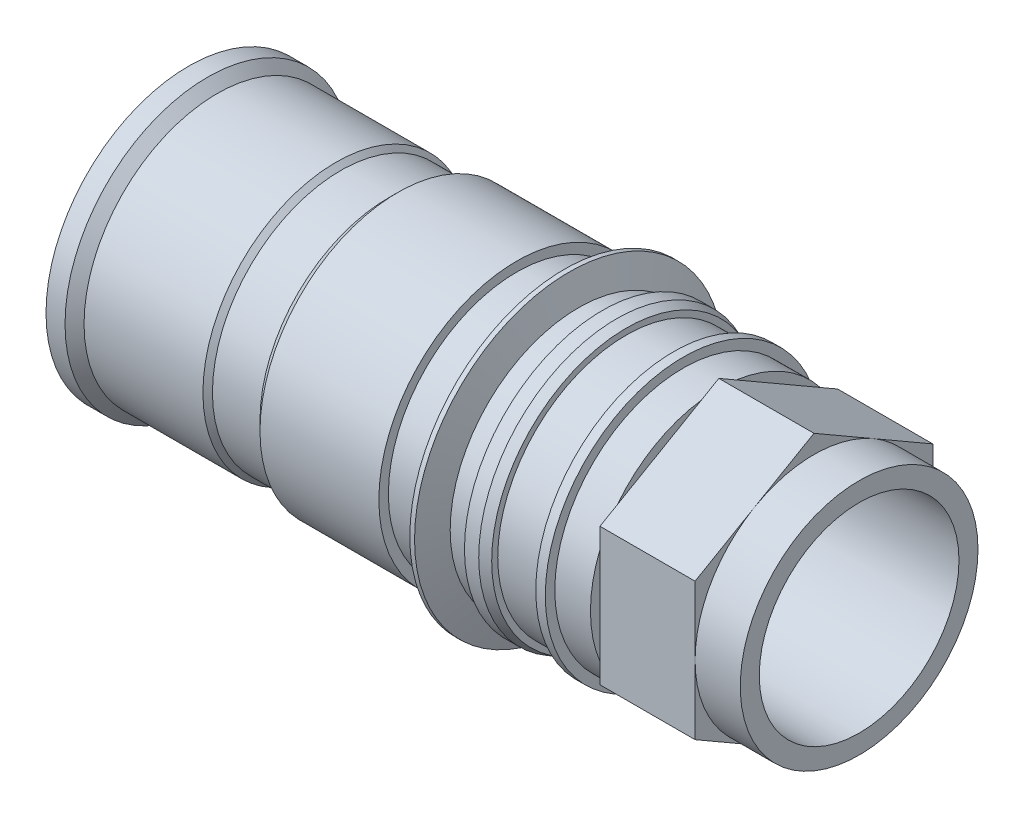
ISO-10303-21;
HEADER;
FILE_DESCRIPTION(('STEP AP214'),'2;1');
FILE_NAME('part.step','',(''),(''),'','','');
FILE_SCHEMA(('AUTOMOTIVE_DESIGN { 1 0 10303 214 1 1 1 1 }'));
ENDSEC;
DATA;
#1=APPLICATION_CONTEXT('core data for automotive mechanical design processes');
#2=APPLICATION_PROTOCOL_DEFINITION('international standard','automotive_design',2000,#1);
#3=PRODUCT_CONTEXT('',#1,'mechanical');
#4=PRODUCT('Part','Part','',(#3));
#5=PRODUCT_RELATED_PRODUCT_CATEGORY('part','',(#4));
#6=PRODUCT_DEFINITION_FORMATION('','',#4);
#7=PRODUCT_DEFINITION_CONTEXT('part definition',#1,'design');
#8=PRODUCT_DEFINITION('design','',#6,#7);
#9=PRODUCT_DEFINITION_SHAPE('','',#8);
#10=(LENGTH_UNIT() NAMED_UNIT(*) SI_UNIT(.MILLI.,.METRE.));
#11=(NAMED_UNIT(*) PLANE_ANGLE_UNIT() SI_UNIT($,.RADIAN.));
#12=(NAMED_UNIT(*) SI_UNIT($,.STERADIAN.) SOLID_ANGLE_UNIT());
#13=UNCERTAINTY_MEASURE_WITH_UNIT(LENGTH_MEASURE(1.E-05),#10,'distance_accuracy_value','');
#14=(GEOMETRIC_REPRESENTATION_CONTEXT(3) GLOBAL_UNCERTAINTY_ASSIGNED_CONTEXT((#13)) GLOBAL_UNIT_ASSIGNED_CONTEXT((#10,
#11,#12)) REPRESENTATION_CONTEXT('',''));
#15=CARTESIAN_POINT('',(0.,0.,0.));
#16=DIRECTION('',(0.,0.,1.));
#17=DIRECTION('',(1.,0.,0.));
#18=AXIS2_PLACEMENT_3D('',#15,#16,#17);
#19=CARTESIAN_POINT('',(131.5,0.,0.));
#20=DIRECTION('',(1.,0.,0.));
#21=DIRECTION('',(0.,0.,-1.));
#22=AXIS2_PLACEMENT_3D('',#19,#20,#21);
#23=PLANE('',#22);
#24=CARTESIAN_POINT('',(131.5,0.,0.));
#25=DIRECTION('',(1.,0.,0.));
#26=DIRECTION('',(0.,0.,-1.));
#27=AXIS2_PLACEMENT_3D('',#24,#25,#26);
#28=CIRCLE('',#27,25.);
#29=CARTESIAN_POINT('',(131.5,0.,-25.));
#30=VERTEX_POINT('',#29);
#31=CARTESIAN_POINT('',(131.5,21.650635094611,-12.5));
#32=VERTEX_POINT('',#31);
#33=EDGE_CURVE('E44',#30,#32,#28,.T.);
#34=ORIENTED_EDGE('',*,*,#33,.F.);
#35=DIRECTION('',(0.,1.,0.));
#36=VECTOR('',#35,1.);
#37=CARTESIAN_POINT('',(131.5,-14.4337567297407,-25.));
#38=LINE('',#37,#36);
#39=CARTESIAN_POINT('',(131.5,14.4337567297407,-25.));
#40=VERTEX_POINT('',#39);
#41=EDGE_CURVE('E150',#30,#40,#38,.T.);
#42=ORIENTED_EDGE('',*,*,#41,.T.);
#43=DIRECTION('',(0.,0.5,0.866025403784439));
#44=VECTOR('',#43,1.);
#45=CARTESIAN_POINT('',(131.5,14.4337567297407,-25.));
#46=LINE('',#45,#44);
#47=EDGE_CURVE('E162',#40,#32,#46,.T.);
#48=ORIENTED_EDGE('',*,*,#47,.T.);
#49=EDGE_LOOP('',(#34,#42,#48));
#50=FACE_BOUND('',#49,.T.);
#51=ADVANCED_FACE('F33',(#50),#23,.T.);
#52=CARTESIAN_POINT('',(131.5,21.650635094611,12.5));
#53=VERTEX_POINT('',#52);
#54=EDGE_CURVE('E11',#32,#53,#28,.T.);
#55=ORIENTED_EDGE('',*,*,#54,.F.);
#56=CARTESIAN_POINT('',(131.5,28.8675134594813,0.));
#57=VERTEX_POINT('',#56);
#58=EDGE_CURVE('E180',#32,#57,#46,.T.);
#59=ORIENTED_EDGE('',*,*,#58,.T.);
#60=DIRECTION('',(0.,-0.5,0.866025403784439));
#61=VECTOR('',#60,1.);
#62=CARTESIAN_POINT('',(131.5,28.8675134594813,0.));
#63=LINE('',#62,#61);
#64=EDGE_CURVE('E181',#57,#53,#63,.T.);
#65=ORIENTED_EDGE('',*,*,#64,.T.);
#66=EDGE_LOOP('',(#55,#59,#65));
#67=FACE_BOUND('',#66,.T.);
#68=ADVANCED_FACE('F371',(#67),#23,.T.);
#69=CARTESIAN_POINT('',(131.5,0.,25.));
#70=VERTEX_POINT('',#69);
#71=EDGE_CURVE('E42',#53,#70,#28,.T.);
#72=ORIENTED_EDGE('',*,*,#71,.F.);
#73=CARTESIAN_POINT('',(131.5,14.4337567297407,25.));
#74=VERTEX_POINT('',#73);
#75=EDGE_CURVE('E179',#53,#74,#63,.T.);
#76=ORIENTED_EDGE('',*,*,#75,.T.);
#77=DIRECTION('',(0.,-1.,0.));
#78=VECTOR('',#77,1.);
#79=CARTESIAN_POINT('',(131.5,14.4337567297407,25.));
#80=LINE('',#79,#78);
#81=EDGE_CURVE('E185',#74,#70,#80,.T.);
#82=ORIENTED_EDGE('',*,*,#81,.T.);
#83=EDGE_LOOP('',(#72,#76,#82));
#84=FACE_BOUND('',#83,.T.);
#85=ADVANCED_FACE('F376',(#84),#23,.T.);
#86=CARTESIAN_POINT('',(131.5,-21.650635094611,12.5));
#87=VERTEX_POINT('',#86);
#88=EDGE_CURVE('E169',#70,#87,#28,.T.);
#89=ORIENTED_EDGE('',*,*,#88,.F.);
#90=CARTESIAN_POINT('',(131.5,-14.4337567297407,25.));
#91=VERTEX_POINT('',#90);
#92=EDGE_CURVE('E184',#70,#91,#80,.T.);
#93=ORIENTED_EDGE('',*,*,#92,.T.);
#94=DIRECTION('',(0.,-0.5,-0.866025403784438));
#95=VECTOR('',#94,1.);
#96=CARTESIAN_POINT('',(131.5,-14.4337567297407,25.));
#97=LINE('',#96,#95);
#98=EDGE_CURVE('E189',#91,#87,#97,.T.);
#99=ORIENTED_EDGE('',*,*,#98,.T.);
#100=EDGE_LOOP('',(#89,#93,#99));
#101=FACE_BOUND('',#100,.T.);
#102=ADVANCED_FACE('F390',(#101),#23,.T.);
#103=CARTESIAN_POINT('',(131.5,-21.650635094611,-12.5));
#104=VERTEX_POINT('',#103);
#105=EDGE_CURVE('E59',#87,#104,#28,.T.);
#106=ORIENTED_EDGE('',*,*,#105,.F.);
#107=CARTESIAN_POINT('',(131.5,-28.8675134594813,0.));
#108=VERTEX_POINT('',#107);
#109=EDGE_CURVE('E188',#87,#108,#97,.T.);
#110=ORIENTED_EDGE('',*,*,#109,.T.);
#111=DIRECTION('',(0.,0.5,-0.866025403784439));
#112=VECTOR('',#111,1.);
#113=CARTESIAN_POINT('',(131.5,-28.8675134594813,0.));
#114=LINE('',#113,#112);
#115=EDGE_CURVE('E160',#108,#104,#114,.T.);
#116=ORIENTED_EDGE('',*,*,#115,.T.);
#117=EDGE_LOOP('',(#106,#110,#116));
#118=FACE_BOUND('',#117,.T.);
#119=ADVANCED_FACE('F381',(#118),#23,.T.);
#120=CARTESIAN_POINT('',(111.5,27.,0.));
#121=DIRECTION('',(-1.,0.,0.));
#122=DIRECTION('',(0.,0.,1.));
#123=AXIS2_PLACEMENT_3D('',#120,#121,#122);
#124=PLANE('',#123);
#125=DIRECTION('',(0.,0.5,0.866025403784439));
#126=VECTOR('',#125,1.);
#127=CARTESIAN_POINT('',(111.5,14.4337567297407,-25.));
#128=LINE('',#127,#126);
#129=CARTESIAN_POINT('',(111.5,16.5516155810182,-21.3317608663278));
#130=VERTEX_POINT('',#129);
#131=CARTESIAN_POINT('',(111.5,26.7496546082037,-3.6682391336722));
#132=VERTEX_POINT('',#131);
#133=EDGE_CURVE('E168',#130,#132,#128,.T.);
#134=ORIENTED_EDGE('',*,*,#133,.F.);
#135=CARTESIAN_POINT('',(111.5,0.,0.));
#136=DIRECTION('',(-1.,0.,0.));
#137=DIRECTION('',(0.,0.,1.));
#138=AXIS2_PLACEMENT_3D('',#135,#136,#137);
#139=CIRCLE('',#138,27.);
#140=EDGE_CURVE('E328',#132,#130,#139,.T.);
#141=ORIENTED_EDGE('',*,*,#140,.F.);
#142=EDGE_LOOP('',(#134,#141));
#143=FACE_BOUND('',#142,.T.);
#144=ADVANCED_FACE('F365',(#143),#124,.F.);
#145=DIRECTION('',(0.,1.,0.));
#146=VECTOR('',#145,1.);
#147=CARTESIAN_POINT('',(111.5,-14.4337567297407,-25.));
#148=LINE('',#147,#146);
#149=CARTESIAN_POINT('',(111.5,-10.1980390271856,-25.));
#150=VERTEX_POINT('',#149);
#151=CARTESIAN_POINT('',(111.5,10.1980390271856,-25.));
#152=VERTEX_POINT('',#151);
#153=EDGE_CURVE('E171',#150,#152,#148,.T.);
#154=ORIENTED_EDGE('',*,*,#153,.F.);
#155=EDGE_CURVE('E334',#152,#150,#139,.T.);
#156=ORIENTED_EDGE('',*,*,#155,.F.);
#157=EDGE_LOOP('',(#154,#156));
#158=FACE_BOUND('',#157,.T.);
#159=ADVANCED_FACE('F395',(#158),#124,.F.);
#160=DIRECTION('',(0.,0.5,-0.866025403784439));
#161=VECTOR('',#160,1.);
#162=CARTESIAN_POINT('',(111.5,-28.8675134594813,0.));
#163=LINE('',#162,#161);
#164=CARTESIAN_POINT('',(111.5,-26.7496546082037,-3.6682391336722));
#165=VERTEX_POINT('',#164);
#166=CARTESIAN_POINT('',(111.5,-16.5516155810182,-21.3317608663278));
#167=VERTEX_POINT('',#166);
#168=EDGE_CURVE('E214',#165,#167,#163,.T.);
#169=ORIENTED_EDGE('',*,*,#168,.F.);
#170=EDGE_CURVE('E340',#167,#165,#139,.T.);
#171=ORIENTED_EDGE('',*,*,#170,.F.);
#172=EDGE_LOOP('',(#169,#171));
#173=FACE_BOUND('',#172,.T.);
#174=ADVANCED_FACE('F366',(#173),#124,.F.);
#175=DIRECTION('',(0.,-0.5,-0.866025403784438));
#176=VECTOR('',#175,1.);
#177=CARTESIAN_POINT('',(111.5,-14.4337567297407,25.));
#178=LINE('',#177,#176);
#179=CARTESIAN_POINT('',(111.5,-16.5516155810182,21.3317608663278));
#180=VERTEX_POINT('',#179);
#181=CARTESIAN_POINT('',(111.5,-26.7496546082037,3.66823913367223));
#182=VERTEX_POINT('',#181);
#183=EDGE_CURVE('E209',#180,#182,#178,.T.);
#184=ORIENTED_EDGE('',*,*,#183,.F.);
#185=EDGE_CURVE('E346',#182,#180,#139,.T.);
#186=ORIENTED_EDGE('',*,*,#185,.F.);
#187=EDGE_LOOP('',(#184,#186));
#188=FACE_BOUND('',#187,.T.);
#189=ADVANCED_FACE('F359',(#188),#124,.F.);
#190=DIRECTION('',(0.,-1.,0.));
#191=VECTOR('',#190,1.);
#192=CARTESIAN_POINT('',(111.5,14.4337567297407,25.));
#193=LINE('',#192,#191);
#194=CARTESIAN_POINT('',(111.5,10.1980390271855,25.));
#195=VERTEX_POINT('',#194);
#196=CARTESIAN_POINT('',(111.5,-10.1980390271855,25.));
#197=VERTEX_POINT('',#196);
#198=EDGE_CURVE('E204',#195,#197,#193,.T.);
#199=ORIENTED_EDGE('',*,*,#198,.F.);
#200=EDGE_CURVE('E232',#197,#195,#139,.T.);
#201=ORIENTED_EDGE('',*,*,#200,.F.);
#202=EDGE_LOOP('',(#199,#201));
#203=FACE_BOUND('',#202,.T.);
#204=ADVANCED_FACE('F357',(#203),#124,.F.);
#205=DIRECTION('',(0.,-0.5,0.866025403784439));
#206=VECTOR('',#205,1.);
#207=CARTESIAN_POINT('',(111.5,28.8675134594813,0.));
#208=LINE('',#207,#206);
#209=CARTESIAN_POINT('',(111.5,26.7496546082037,3.6682391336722));
#210=VERTEX_POINT('',#209);
#211=CARTESIAN_POINT('',(111.5,16.5516155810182,21.3317608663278));
#212=VERTEX_POINT('',#211);
#213=EDGE_CURVE('E199',#210,#212,#208,.T.);
#214=ORIENTED_EDGE('',*,*,#213,.F.);
#215=EDGE_CURVE('E236',#212,#210,#139,.T.);
#216=ORIENTED_EDGE('',*,*,#215,.F.);
#217=EDGE_LOOP('',(#214,#216));
#218=FACE_BOUND('',#217,.T.);
#219=ADVANCED_FACE('F326',(#218),#124,.F.);
#220=CARTESIAN_POINT('',(0.,0.,0.));
#221=DIRECTION('',(1.,0.,0.));
#222=DIRECTION('',(0.,0.,-1.));
#223=AXIS2_PLACEMENT_3D('',#220,#221,#222);
#224=PLANE('',#223);
#225=CARTESIAN_POINT('',(0.,0.,0.));
#226=DIRECTION('',(1.,0.,0.));
#227=DIRECTION('',(0.,0.,-1.));
#228=AXIS2_PLACEMENT_3D('',#225,#226,#227);
#229=CIRCLE('',#228,21.);
#230=CARTESIAN_POINT('',(0.,0.,-21.));
#231=VERTEX_POINT('',#230);
#232=EDGE_CURVE('E165',#231,#231,#229,.T.);
#233=ORIENTED_EDGE('',*,*,#232,.T.);
#234=EDGE_LOOP('',(#233));
#235=FACE_BOUND('',#234,.T.);
#236=CARTESIAN_POINT('',(0.,0.,0.));
#237=DIRECTION('',(-1.,0.,0.));
#238=DIRECTION('',(0.,0.,1.));
#239=AXIS2_PLACEMENT_3D('',#236,#237,#238);
#240=CIRCLE('',#239,30.);
#241=CARTESIAN_POINT('',(0.,0.,30.));
#242=VERTEX_POINT('',#241);
#243=EDGE_CURVE('E37',#242,#242,#240,.T.);
#244=ORIENTED_EDGE('',*,*,#243,.T.);
#245=EDGE_LOOP('',(#244));
#246=FACE_BOUND('',#245,.T.);
#247=ADVANCED_FACE('F35',(#235,#246),#224,.F.);
#248=CARTESIAN_POINT('',(0.,0.,0.));
#249=DIRECTION('',(-1.,0.,0.));
#250=DIRECTION('',(0.,0.,1.));
#251=AXIS2_PLACEMENT_3D('',#248,#249,#250);
#252=CYLINDRICAL_SURFACE('',#251,30.);
#253=ORIENTED_EDGE('',*,*,#243,.F.);
#254=EDGE_LOOP('',(#253));
#255=FACE_BOUND('',#254,.T.);
#256=CARTESIAN_POINT('',(4.,0.,0.));
#257=DIRECTION('',(-1.,0.,0.));
#258=DIRECTION('',(0.,0.,1.));
#259=AXIS2_PLACEMENT_3D('',#256,#257,#258);
#260=CIRCLE('',#259,30.);
#261=CARTESIAN_POINT('',(4.,0.,30.));
#262=VERTEX_POINT('',#261);
#263=EDGE_CURVE('E295',#262,#262,#260,.T.);
#264=ORIENTED_EDGE('',*,*,#263,.T.);
#265=EDGE_LOOP('',(#264));
#266=FACE_BOUND('',#265,.T.);
#267=ADVANCED_FACE('F490',(#255,#266),#252,.T.);
#268=CARTESIAN_POINT('',(6.,0.,0.));
#269=DIRECTION('',(-1.,0.,0.));
#270=DIRECTION('',(0.,0.,1.));
#271=AXIS2_PLACEMENT_3D('',#268,#269,#270);
#272=CONICAL_SURFACE('',#271,28.,0.78539816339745);
#273=ORIENTED_EDGE('',*,*,#263,.F.);
#274=EDGE_LOOP('',(#273));
#275=FACE_BOUND('',#274,.T.);
#276=CARTESIAN_POINT('',(6.,0.,0.));
#277=DIRECTION('',(-1.,0.,0.));
#278=DIRECTION('',(0.,0.,1.));
#279=AXIS2_PLACEMENT_3D('',#276,#277,#278);
#280=CIRCLE('',#279,28.);
#281=CARTESIAN_POINT('',(6.,0.,28.));
#282=VERTEX_POINT('',#281);
#283=EDGE_CURVE('E293',#282,#282,#280,.T.);
#284=ORIENTED_EDGE('',*,*,#283,.T.);
#285=EDGE_LOOP('',(#284));
#286=FACE_BOUND('',#285,.T.);
#287=ADVANCED_FACE('F528',(#275,#286),#272,.T.);
#288=CARTESIAN_POINT('',(0.,0.,0.));
#289=DIRECTION('',(-1.,0.,0.));
#290=DIRECTION('',(0.,0.,1.));
#291=AXIS2_PLACEMENT_3D('',#288,#289,#290);
#292=CYLINDRICAL_SURFACE('',#291,28.);
#293=ORIENTED_EDGE('',*,*,#283,.F.);
#294=EDGE_LOOP('',(#293));
#295=FACE_BOUND('',#294,.T.);
#296=CARTESIAN_POINT('',(31.,0.,0.));
#297=DIRECTION('',(-1.,0.,0.));
#298=DIRECTION('',(0.,0.,1.));
#299=AXIS2_PLACEMENT_3D('',#296,#297,#298);
#300=CIRCLE('',#299,28.);
#301=CARTESIAN_POINT('',(31.,0.,28.));
#302=VERTEX_POINT('',#301);
#303=EDGE_CURVE('E290',#302,#302,#300,.T.);
#304=ORIENTED_EDGE('',*,*,#303,.T.);
#305=EDGE_LOOP('',(#304));
#306=FACE_BOUND('',#305,.T.);
#307=ADVANCED_FACE('F534',(#295,#306),#292,.T.);
#308=CARTESIAN_POINT('',(32.,0.,0.));
#309=DIRECTION('',(-1.,0.,0.));
#310=DIRECTION('',(0.,0.,1.));
#311=AXIS2_PLACEMENT_3D('',#308,#309,#310);
#312=CONICAL_SURFACE('',#311,27.,0.785398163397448);
#313=ORIENTED_EDGE('',*,*,#303,.F.);
#314=EDGE_LOOP('',(#313));
#315=FACE_BOUND('',#314,.T.);
#316=CARTESIAN_POINT('',(32.,0.,0.));
#317=DIRECTION('',(-1.,0.,0.));
#318=DIRECTION('',(0.,0.,1.));
#319=AXIS2_PLACEMENT_3D('',#316,#317,#318);
#320=CIRCLE('',#319,27.);
#321=CARTESIAN_POINT('',(32.,0.,27.));
#322=VERTEX_POINT('',#321);
#323=EDGE_CURVE('E287',#322,#322,#320,.T.);
#324=ORIENTED_EDGE('',*,*,#323,.T.);
#325=EDGE_LOOP('',(#324));
#326=FACE_BOUND('',#325,.T.);
#327=ADVANCED_FACE('F542',(#315,#326),#312,.T.);
#328=CARTESIAN_POINT('',(0.,0.,0.));
#329=DIRECTION('',(-1.,0.,0.));
#330=DIRECTION('',(0.,0.,1.));
#331=AXIS2_PLACEMENT_3D('',#328,#329,#330);
#332=CYLINDRICAL_SURFACE('',#331,27.);
#333=ORIENTED_EDGE('',*,*,#323,.F.);
#334=EDGE_LOOP('',(#333));
#335=FACE_BOUND('',#334,.T.);
#336=CARTESIAN_POINT('',(42.,0.,0.));
#337=DIRECTION('',(-1.,0.,0.));
#338=DIRECTION('',(0.,0.,1.));
#339=AXIS2_PLACEMENT_3D('',#336,#337,#338);
#340=CIRCLE('',#339,27.);
#341=CARTESIAN_POINT('',(42.,0.,27.));
#342=VERTEX_POINT('',#341);
#343=EDGE_CURVE('E284',#342,#342,#340,.T.);
#344=ORIENTED_EDGE('',*,*,#343,.T.);
#345=EDGE_LOOP('',(#344));
#346=FACE_BOUND('',#345,.T.);
#347=ADVANCED_FACE('F550',(#335,#346),#332,.T.);
#348=CARTESIAN_POINT('',(44.,0.,0.));
#349=DIRECTION('',(1.,0.,0.));
#350=DIRECTION('',(0.,0.,-1.));
#351=AXIS2_PLACEMENT_3D('',#348,#349,#350);
#352=CONICAL_SURFACE('',#351,29.,0.785398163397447);
#353=ORIENTED_EDGE('',*,*,#343,.F.);
#354=EDGE_LOOP('',(#353));
#355=FACE_BOUND('',#354,.T.);
#356=CARTESIAN_POINT('',(44.,0.,0.));
#357=DIRECTION('',(-1.,0.,0.));
#358=DIRECTION('',(0.,0.,1.));
#359=AXIS2_PLACEMENT_3D('',#356,#357,#358);
#360=CIRCLE('',#359,29.);
#361=CARTESIAN_POINT('',(44.,0.,29.));
#362=VERTEX_POINT('',#361);
#363=EDGE_CURVE('E281',#362,#362,#360,.T.);
#364=ORIENTED_EDGE('',*,*,#363,.T.);
#365=EDGE_LOOP('',(#364));
#366=FACE_BOUND('',#365,.T.);
#367=ADVANCED_FACE('F558',(#355,#366),#352,.T.);
#368=CARTESIAN_POINT('',(0.,0.,0.));
#369=DIRECTION('',(-1.,0.,0.));
#370=DIRECTION('',(0.,0.,1.));
#371=AXIS2_PLACEMENT_3D('',#368,#369,#370);
#372=CYLINDRICAL_SURFACE('',#371,29.);
#373=ORIENTED_EDGE('',*,*,#363,.F.);
#374=EDGE_LOOP('',(#373));
#375=FACE_BOUND('',#374,.T.);
#376=CARTESIAN_POINT('',(69.,0.,0.));
#377=DIRECTION('',(-1.,0.,0.));
#378=DIRECTION('',(0.,0.,1.));
#379=AXIS2_PLACEMENT_3D('',#376,#377,#378);
#380=CIRCLE('',#379,29.);
#381=CARTESIAN_POINT('',(69.,0.,29.));
#382=VERTEX_POINT('',#381);
#383=EDGE_CURVE('E278',#382,#382,#380,.T.);
#384=ORIENTED_EDGE('',*,*,#383,.T.);
#385=EDGE_LOOP('',(#384));
#386=FACE_BOUND('',#385,.T.);
#387=ADVANCED_FACE('F566',(#375,#386),#372,.T.);
#388=CARTESIAN_POINT('',(69.,29.,0.));
#389=DIRECTION('',(-1.,0.,0.));
#390=DIRECTION('',(0.,0.,1.));
#391=AXIS2_PLACEMENT_3D('',#388,#389,#390);
#392=PLANE('',#391);
#393=ORIENTED_EDGE('',*,*,#383,.F.);
#394=EDGE_LOOP('',(#393));
#395=FACE_BOUND('',#394,.T.);
#396=CARTESIAN_POINT('',(69.,0.,0.));
#397=DIRECTION('',(-1.,0.,0.));
#398=DIRECTION('',(0.,0.,1.));
#399=AXIS2_PLACEMENT_3D('',#396,#397,#398);
#400=CIRCLE('',#399,27.);
#401=CARTESIAN_POINT('',(69.,0.,27.));
#402=VERTEX_POINT('',#401);
#403=EDGE_CURVE('E275',#402,#402,#400,.T.);
#404=ORIENTED_EDGE('',*,*,#403,.T.);
#405=EDGE_LOOP('',(#404));
#406=FACE_BOUND('',#405,.T.);
#407=ADVANCED_FACE('F574',(#395,#406),#392,.F.);
#408=CARTESIAN_POINT('',(0.,0.,0.));
#409=DIRECTION('',(-1.,0.,0.));
#410=DIRECTION('',(0.,0.,1.));
#411=AXIS2_PLACEMENT_3D('',#408,#409,#410);
#412=CYLINDRICAL_SURFACE('',#411,27.);
#413=ORIENTED_EDGE('',*,*,#403,.F.);
#414=EDGE_LOOP('',(#413));
#415=FACE_BOUND('',#414,.T.);
#416=CARTESIAN_POINT('',(77.,0.,0.));
#417=DIRECTION('',(-1.,0.,0.));
#418=DIRECTION('',(0.,0.,1.));
#419=AXIS2_PLACEMENT_3D('',#416,#417,#418);
#420=CIRCLE('',#419,27.);
#421=CARTESIAN_POINT('',(77.,0.,27.));
#422=VERTEX_POINT('',#421);
#423=EDGE_CURVE('E272',#422,#422,#420,.T.);
#424=ORIENTED_EDGE('',*,*,#423,.T.);
#425=EDGE_LOOP('',(#424));
#426=FACE_BOUND('',#425,.T.);
#427=ADVANCED_FACE('F582',(#415,#426),#412,.T.);
#428=CARTESIAN_POINT('',(79.,0.,0.));
#429=DIRECTION('',(1.,0.,0.));
#430=DIRECTION('',(0.,0.,-1.));
#431=AXIS2_PLACEMENT_3D('',#428,#429,#430);
#432=CONICAL_SURFACE('',#431,32.4949548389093,1.22173047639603);
#433=ORIENTED_EDGE('',*,*,#423,.F.);
#434=EDGE_LOOP('',(#433));
#435=FACE_BOUND('',#434,.T.);
#436=CARTESIAN_POINT('',(79.,0.,0.));
#437=DIRECTION('',(-1.,0.,0.));
#438=DIRECTION('',(0.,0.,1.));
#439=AXIS2_PLACEMENT_3D('',#436,#437,#438);
#440=CIRCLE('',#439,32.4949548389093);
#441=CARTESIAN_POINT('',(79.,0.,32.4949548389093));
#442=VERTEX_POINT('',#441);
#443=EDGE_CURVE('E269',#442,#442,#440,.T.);
#444=ORIENTED_EDGE('',*,*,#443,.T.);
#445=EDGE_LOOP('',(#444));
#446=FACE_BOUND('',#445,.T.);
#447=ADVANCED_FACE('F590',(#435,#446),#432,.T.);
#448=CARTESIAN_POINT('',(0.,0.,0.));
#449=DIRECTION('',(-1.,0.,0.));
#450=DIRECTION('',(0.,0.,1.));
#451=AXIS2_PLACEMENT_3D('',#448,#449,#450);
#452=CYLINDRICAL_SURFACE('',#451,32.4949548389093);
#453=ORIENTED_EDGE('',*,*,#443,.F.);
#454=EDGE_LOOP('',(#453));
#455=FACE_BOUND('',#454,.T.);
#456=CARTESIAN_POINT('',(80.,0.,0.));
#457=DIRECTION('',(-1.,0.,0.));
#458=DIRECTION('',(0.,0.,1.));
#459=AXIS2_PLACEMENT_3D('',#456,#457,#458);
#460=CIRCLE('',#459,32.4949548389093);
#461=CARTESIAN_POINT('',(80.,0.,32.4949548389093));
#462=VERTEX_POINT('',#461);
#463=EDGE_CURVE('E266',#462,#462,#460,.T.);
#464=ORIENTED_EDGE('',*,*,#463,.T.);
#465=EDGE_LOOP('',(#464));
#466=FACE_BOUND('',#465,.T.);
#467=ADVANCED_FACE('F598',(#455,#466),#452,.T.);
#468=CARTESIAN_POINT('',(82.,0.,0.));
#469=DIRECTION('',(-1.,0.,0.));
#470=DIRECTION('',(0.,0.,1.));
#471=AXIS2_PLACEMENT_3D('',#468,#469,#470);
#472=CONICAL_SURFACE('',#471,27.,1.22173047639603);
#473=ORIENTED_EDGE('',*,*,#463,.F.);
#474=EDGE_LOOP('',(#473));
#475=FACE_BOUND('',#474,.T.);
#476=CARTESIAN_POINT('',(82.,0.,0.));
#477=DIRECTION('',(-1.,0.,0.));
#478=DIRECTION('',(0.,0.,1.));
#479=AXIS2_PLACEMENT_3D('',#476,#477,#478);
#480=CIRCLE('',#479,27.);
#481=CARTESIAN_POINT('',(82.,0.,27.));
#482=VERTEX_POINT('',#481);
#483=EDGE_CURVE('E263',#482,#482,#480,.T.);
#484=ORIENTED_EDGE('',*,*,#483,.T.);
#485=EDGE_LOOP('',(#484));
#486=FACE_BOUND('',#485,.T.);
#487=ADVANCED_FACE('F606',(#475,#486),#472,.T.);
#488=CARTESIAN_POINT('',(0.,0.,0.));
#489=DIRECTION('',(-1.,0.,0.));
#490=DIRECTION('',(0.,0.,1.));
#491=AXIS2_PLACEMENT_3D('',#488,#489,#490);
#492=CYLINDRICAL_SURFACE('',#491,27.);
#493=ORIENTED_EDGE('',*,*,#483,.F.);
#494=EDGE_LOOP('',(#493));
#495=FACE_BOUND('',#494,.T.);
#496=CARTESIAN_POINT('',(87.,0.,0.));
#497=DIRECTION('',(-1.,0.,0.));
#498=DIRECTION('',(0.,0.,1.));
#499=AXIS2_PLACEMENT_3D('',#496,#497,#498);
#500=CIRCLE('',#499,27.);
#501=CARTESIAN_POINT('',(87.,0.,27.));
#502=VERTEX_POINT('',#501);
#503=EDGE_CURVE('E260',#502,#502,#500,.T.);
#504=ORIENTED_EDGE('',*,*,#503,.T.);
#505=EDGE_LOOP('',(#504));
#506=FACE_BOUND('',#505,.T.);
#507=ADVANCED_FACE('F614',(#495,#506),#492,.T.);
#508=CARTESIAN_POINT('',(87.,27.,0.));
#509=DIRECTION('',(1.,0.,0.));
#510=DIRECTION('',(0.,0.,-1.));
#511=AXIS2_PLACEMENT_3D('',#508,#509,#510);
#512=PLANE('',#511);
#513=ORIENTED_EDGE('',*,*,#503,.F.);
#514=EDGE_LOOP('',(#513));
#515=FACE_BOUND('',#514,.T.);
#516=CARTESIAN_POINT('',(87.,0.,0.));
#517=DIRECTION('',(-1.,0.,0.));
#518=DIRECTION('',(0.,0.,1.));
#519=AXIS2_PLACEMENT_3D('',#516,#517,#518);
#520=CIRCLE('',#519,29.);
#521=CARTESIAN_POINT('',(87.,0.,29.));
#522=VERTEX_POINT('',#521);
#523=EDGE_CURVE('E257',#522,#522,#520,.T.);
#524=ORIENTED_EDGE('',*,*,#523,.T.);
#525=EDGE_LOOP('',(#524));
#526=FACE_BOUND('',#525,.T.);
#527=ADVANCED_FACE('F622',(#515,#526),#512,.F.);
#528=CARTESIAN_POINT('',(0.,0.,0.));
#529=DIRECTION('',(-1.,0.,0.));
#530=DIRECTION('',(0.,0.,1.));
#531=AXIS2_PLACEMENT_3D('',#528,#529,#530);
#532=CYLINDRICAL_SURFACE('',#531,29.);
#533=ORIENTED_EDGE('',*,*,#523,.F.);
#534=EDGE_LOOP('',(#533));
#535=FACE_BOUND('',#534,.T.);
#536=CARTESIAN_POINT('',(90.,0.,0.));
#537=DIRECTION('',(-1.,0.,0.));
#538=DIRECTION('',(0.,0.,1.));
#539=AXIS2_PLACEMENT_3D('',#536,#537,#538);
#540=CIRCLE('',#539,29.);
#541=CARTESIAN_POINT('',(90.,0.,29.));
#542=VERTEX_POINT('',#541);
#543=EDGE_CURVE('E254',#542,#542,#540,.T.);
#544=ORIENTED_EDGE('',*,*,#543,.T.);
#545=EDGE_LOOP('',(#544));
#546=FACE_BOUND('',#545,.T.);
#547=ADVANCED_FACE('F630',(#535,#546),#532,.T.);
#548=CARTESIAN_POINT('',(92.,0.,0.));
#549=DIRECTION('',(-1.,0.,0.));
#550=DIRECTION('',(0.,0.,1.));
#551=AXIS2_PLACEMENT_3D('',#548,#549,#550);
#552=CONICAL_SURFACE('',#551,28.2720595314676,0.349065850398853);
#553=ORIENTED_EDGE('',*,*,#543,.F.);
#554=EDGE_LOOP('',(#553));
#555=FACE_BOUND('',#554,.T.);
#556=CARTESIAN_POINT('',(92.,0.,0.));
#557=DIRECTION('',(-1.,0.,0.));
#558=DIRECTION('',(0.,0.,1.));
#559=AXIS2_PLACEMENT_3D('',#556,#557,#558);
#560=CIRCLE('',#559,28.2720595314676);
#561=CARTESIAN_POINT('',(92.,0.,28.2720595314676));
#562=VERTEX_POINT('',#561);
#563=EDGE_CURVE('E251',#562,#562,#560,.T.);
#564=ORIENTED_EDGE('',*,*,#563,.T.);
#565=EDGE_LOOP('',(#564));
#566=FACE_BOUND('',#565,.T.);
#567=ADVANCED_FACE('F638',(#555,#566),#552,.T.);
#568=CARTESIAN_POINT('',(92.,28.2720595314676,0.));
#569=DIRECTION('',(-1.,0.,0.));
#570=DIRECTION('',(0.,0.,1.));
#571=AXIS2_PLACEMENT_3D('',#568,#569,#570);
#572=PLANE('',#571);
#573=ORIENTED_EDGE('',*,*,#563,.F.);
#574=EDGE_LOOP('',(#573));
#575=FACE_BOUND('',#574,.T.);
#576=CARTESIAN_POINT('',(92.,0.,0.));
#577=DIRECTION('',(-1.,0.,0.));
#578=DIRECTION('',(0.,0.,1.));
#579=AXIS2_PLACEMENT_3D('',#576,#577,#578);
#580=CIRCLE('',#579,27.);
#581=CARTESIAN_POINT('',(92.,0.,27.));
#582=VERTEX_POINT('',#581);
#583=EDGE_CURVE('E248',#582,#582,#580,.T.);
#584=ORIENTED_EDGE('',*,*,#583,.T.);
#585=EDGE_LOOP('',(#584));
#586=FACE_BOUND('',#585,.T.);
#587=ADVANCED_FACE('F646',(#575,#586),#572,.F.);
#588=CARTESIAN_POINT('',(0.,0.,0.));
#589=DIRECTION('',(-1.,0.,0.));
#590=DIRECTION('',(0.,0.,1.));
#591=AXIS2_PLACEMENT_3D('',#588,#589,#590);
#592=CYLINDRICAL_SURFACE('',#591,27.);
#593=ORIENTED_EDGE('',*,*,#583,.F.);
#594=EDGE_LOOP('',(#593));
#595=FACE_BOUND('',#594,.T.);
#596=CARTESIAN_POINT('',(102.,0.,0.));
#597=DIRECTION('',(-1.,0.,0.));
#598=DIRECTION('',(0.,0.,1.));
#599=AXIS2_PLACEMENT_3D('',#596,#597,#598);
#600=CIRCLE('',#599,27.);
#601=CARTESIAN_POINT('',(102.,0.,27.));
#602=VERTEX_POINT('',#601);
#603=EDGE_CURVE('E245',#602,#602,#600,.T.);
#604=ORIENTED_EDGE('',*,*,#603,.T.);
#605=EDGE_LOOP('',(#604));
#606=FACE_BOUND('',#605,.T.);
#607=ADVANCED_FACE('F654',(#595,#606),#592,.T.);
#608=CARTESIAN_POINT('',(102.,27.,0.));
#609=DIRECTION('',(1.,0.,0.));
#610=DIRECTION('',(0.,0.,-1.));
#611=AXIS2_PLACEMENT_3D('',#608,#609,#610);
#612=PLANE('',#611);
#613=ORIENTED_EDGE('',*,*,#603,.F.);
#614=EDGE_LOOP('',(#613));
#615=FACE_BOUND('',#614,.T.);
#616=CARTESIAN_POINT('',(102.,0.,0.));
#617=DIRECTION('',(-1.,0.,0.));
#618=DIRECTION('',(0.,0.,1.));
#619=AXIS2_PLACEMENT_3D('',#616,#617,#618);
#620=CIRCLE('',#619,29.);
#621=CARTESIAN_POINT('',(102.,0.,29.));
#622=VERTEX_POINT('',#621);
#623=EDGE_CURVE('E242',#622,#622,#620,.T.);
#624=ORIENTED_EDGE('',*,*,#623,.T.);
#625=EDGE_LOOP('',(#624));
#626=FACE_BOUND('',#625,.T.);
#627=ADVANCED_FACE('F662',(#615,#626),#612,.F.);
#628=CARTESIAN_POINT('',(0.,0.,0.));
#629=DIRECTION('',(-1.,0.,0.));
#630=DIRECTION('',(0.,0.,1.));
#631=AXIS2_PLACEMENT_3D('',#628,#629,#630);
#632=CYLINDRICAL_SURFACE('',#631,29.);
#633=ORIENTED_EDGE('',*,*,#623,.F.);
#634=EDGE_LOOP('',(#633));
#635=FACE_BOUND('',#634,.T.);
#636=CARTESIAN_POINT('',(104.,0.,0.));
#637=DIRECTION('',(-1.,0.,0.));
#638=DIRECTION('',(0.,0.,1.));
#639=AXIS2_PLACEMENT_3D('',#636,#637,#638);
#640=CIRCLE('',#639,29.);
#641=CARTESIAN_POINT('',(104.,0.,29.));
#642=VERTEX_POINT('',#641);
#643=EDGE_CURVE('E239',#642,#642,#640,.T.);
#644=ORIENTED_EDGE('',*,*,#643,.T.);
#645=EDGE_LOOP('',(#644));
#646=FACE_BOUND('',#645,.T.);
#647=ADVANCED_FACE('F670',(#635,#646),#632,.T.);
#648=CARTESIAN_POINT('',(104.,29.,0.));
#649=DIRECTION('',(-1.,0.,0.));
#650=DIRECTION('',(0.,0.,1.));
#651=AXIS2_PLACEMENT_3D('',#648,#649,#650);
#652=PLANE('',#651);
#653=ORIENTED_EDGE('',*,*,#643,.F.);
#654=EDGE_LOOP('',(#653));
#655=FACE_BOUND('',#654,.T.);
#656=CARTESIAN_POINT('',(104.,0.,0.));
#657=DIRECTION('',(-1.,0.,0.));
#658=DIRECTION('',(0.,0.,1.));
#659=AXIS2_PLACEMENT_3D('',#656,#657,#658);
#660=CIRCLE('',#659,27.);
#661=CARTESIAN_POINT('',(104.,0.,27.));
#662=VERTEX_POINT('',#661);
#663=EDGE_CURVE('E235',#662,#662,#660,.T.);
#664=ORIENTED_EDGE('',*,*,#663,.T.);
#665=EDGE_LOOP('',(#664));
#666=FACE_BOUND('',#665,.T.);
#667=ADVANCED_FACE('F678',(#655,#666),#652,.F.);
#668=CARTESIAN_POINT('',(0.,0.,0.));
#669=DIRECTION('',(-1.,0.,0.));
#670=DIRECTION('',(0.,0.,1.));
#671=AXIS2_PLACEMENT_3D('',#668,#669,#670);
#672=CYLINDRICAL_SURFACE('',#671,27.);
#673=ORIENTED_EDGE('',*,*,#663,.F.);
#674=EDGE_LOOP('',(#673));
#675=FACE_BOUND('',#674,.T.);
#676=EDGE_CURVE('E233',#195,#212,#139,.T.);
#677=ORIENTED_EDGE('',*,*,#676,.T.);
#678=ORIENTED_EDGE('',*,*,#215,.T.);
#679=EDGE_CURVE('E327',#210,#132,#139,.T.);
#680=ORIENTED_EDGE('',*,*,#679,.T.);
#681=ORIENTED_EDGE('',*,*,#140,.T.);
#682=EDGE_CURVE('E331',#130,#152,#139,.T.);
#683=ORIENTED_EDGE('',*,*,#682,.T.);
#684=ORIENTED_EDGE('',*,*,#155,.T.);
#685=EDGE_CURVE('E337',#150,#167,#139,.T.);
#686=ORIENTED_EDGE('',*,*,#685,.T.);
#687=ORIENTED_EDGE('',*,*,#170,.T.);
#688=EDGE_CURVE('E343',#165,#182,#139,.T.);
#689=ORIENTED_EDGE('',*,*,#688,.T.);
#690=ORIENTED_EDGE('',*,*,#185,.T.);
#691=EDGE_CURVE('E349',#180,#197,#139,.T.);
#692=ORIENTED_EDGE('',*,*,#691,.T.);
#693=ORIENTED_EDGE('',*,*,#200,.T.);
#694=EDGE_LOOP('',(#677,#678,#680,#681,#683,#684,#686,#687,#689,#690,#692,#693));
#695=FACE_BOUND('',#694,.T.);
#696=ADVANCED_FACE('F321',(#675,#695),#672,.T.);
#697=CARTESIAN_POINT('',(111.5,0.,0.));
#698=DIRECTION('',(1.,0.,0.));
#699=DIRECTION('',(0.,0.,-1.));
#700=AXIS2_PLACEMENT_3D('',#697,#698,#699);
#701=PLANE('',#700);
#702=ORIENTED_EDGE('',*,*,#676,.F.);
#703=CARTESIAN_POINT('',(111.5,14.4337567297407,25.));
#704=VERTEX_POINT('',#703);
#705=EDGE_CURVE('E200',#704,#195,#193,.T.);
#706=ORIENTED_EDGE('',*,*,#705,.F.);
#707=EDGE_CURVE('E194',#212,#704,#208,.T.);
#708=ORIENTED_EDGE('',*,*,#707,.F.);
#709=EDGE_LOOP('',(#702,#706,#708));
#710=FACE_BOUND('',#709,.T.);
#711=ADVANCED_FACE('F316',(#710),#701,.F.);
#712=ORIENTED_EDGE('',*,*,#679,.F.);
#713=CARTESIAN_POINT('',(111.5,28.8675134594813,0.));
#714=VERTEX_POINT('',#713);
#715=EDGE_CURVE('E195',#714,#210,#208,.T.);
#716=ORIENTED_EDGE('',*,*,#715,.F.);
#717=EDGE_CURVE('E174',#132,#714,#128,.T.);
#718=ORIENTED_EDGE('',*,*,#717,.F.);
#719=EDGE_LOOP('',(#712,#716,#718));
#720=FACE_BOUND('',#719,.T.);
#721=ADVANCED_FACE('F411',(#720),#701,.F.);
#722=ORIENTED_EDGE('',*,*,#682,.F.);
#723=CARTESIAN_POINT('',(111.5,14.4337567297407,-25.));
#724=VERTEX_POINT('',#723);
#725=EDGE_CURVE('E173',#724,#130,#128,.T.);
#726=ORIENTED_EDGE('',*,*,#725,.F.);
#727=EDGE_CURVE('E213',#152,#724,#148,.T.);
#728=ORIENTED_EDGE('',*,*,#727,.F.);
#729=EDGE_LOOP('',(#722,#726,#728));
#730=FACE_BOUND('',#729,.T.);
#731=ADVANCED_FACE('F414',(#730),#701,.F.);
#732=ORIENTED_EDGE('',*,*,#685,.F.);
#733=CARTESIAN_POINT('',(111.5,-14.4337567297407,-25.));
#734=VERTEX_POINT('',#733);
#735=EDGE_CURVE('E215',#734,#150,#148,.T.);
#736=ORIENTED_EDGE('',*,*,#735,.F.);
#737=EDGE_CURVE('E208',#167,#734,#163,.T.);
#738=ORIENTED_EDGE('',*,*,#737,.F.);
#739=EDGE_LOOP('',(#732,#736,#738));
#740=FACE_BOUND('',#739,.T.);
#741=ADVANCED_FACE('F422',(#740),#701,.F.);
#742=ORIENTED_EDGE('',*,*,#688,.F.);
#743=CARTESIAN_POINT('',(111.5,-28.8675134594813,0.));
#744=VERTEX_POINT('',#743);
#745=EDGE_CURVE('E210',#744,#165,#163,.T.);
#746=ORIENTED_EDGE('',*,*,#745,.F.);
#747=EDGE_CURVE('E203',#182,#744,#178,.T.);
#748=ORIENTED_EDGE('',*,*,#747,.F.);
#749=EDGE_LOOP('',(#742,#746,#748));
#750=FACE_BOUND('',#749,.T.);
#751=ADVANCED_FACE('F386',(#750),#701,.F.);
#752=CARTESIAN_POINT('',(131.5,14.4337567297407,-25.));
#753=DIRECTION('',(0.,-0.866025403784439,0.5));
#754=DIRECTION('',(0.,-0.5,-0.866025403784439));
#755=AXIS2_PLACEMENT_3D('',#752,#753,#754);
#756=PLANE('',#755);
#757=ORIENTED_EDGE('',*,*,#725,.T.);
#758=ORIENTED_EDGE('',*,*,#133,.T.);
#759=ORIENTED_EDGE('',*,*,#717,.T.);
#760=DIRECTION('',(-1.,0.,0.));
#761=VECTOR('',#760,1.);
#762=CARTESIAN_POINT('',(131.5,28.8675134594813,0.));
#763=LINE('',#762,#761);
#764=EDGE_CURVE('E229',#57,#714,#763,.T.);
#765=ORIENTED_EDGE('',*,*,#764,.F.);
#766=ORIENTED_EDGE('',*,*,#58,.F.);
#767=ORIENTED_EDGE('',*,*,#47,.F.);
#768=DIRECTION('',(-1.,0.,0.));
#769=VECTOR('',#768,1.);
#770=CARTESIAN_POINT('',(131.5,14.4337567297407,-25.));
#771=LINE('',#770,#769);
#772=EDGE_CURVE('E149',#40,#724,#771,.T.);
#773=ORIENTED_EDGE('',*,*,#772,.T.);
#774=EDGE_LOOP('',(#757,#758,#759,#765,#766,#767,#773));
#775=FACE_BOUND('',#774,.T.);
#776=ADVANCED_FACE('F408',(#775),#756,.F.);
#777=CARTESIAN_POINT('',(131.5,28.8675134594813,0.));
#778=DIRECTION('',(0.,-0.866025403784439,-0.5));
#779=DIRECTION('',(0.,0.5,-0.866025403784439));
#780=AXIS2_PLACEMENT_3D('',#777,#778,#779);
#781=PLANE('',#780);
#782=ORIENTED_EDGE('',*,*,#715,.T.);
#783=ORIENTED_EDGE('',*,*,#213,.T.);
#784=ORIENTED_EDGE('',*,*,#707,.T.);
#785=DIRECTION('',(-1.,0.,0.));
#786=VECTOR('',#785,1.);
#787=CARTESIAN_POINT('',(131.5,14.4337567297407,25.));
#788=LINE('',#787,#786);
#789=EDGE_CURVE('E226',#74,#704,#788,.T.);
#790=ORIENTED_EDGE('',*,*,#789,.F.);
#791=ORIENTED_EDGE('',*,*,#75,.F.);
#792=ORIENTED_EDGE('',*,*,#64,.F.);
#793=ORIENTED_EDGE('',*,*,#764,.T.);
#794=EDGE_LOOP('',(#782,#783,#784,#790,#791,#792,#793));
#795=FACE_BOUND('',#794,.T.);
#796=ADVANCED_FACE('F307',(#795),#781,.F.);
#797=CARTESIAN_POINT('',(131.5,14.4337567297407,25.));
#798=DIRECTION('',(0.,0.,-1.));
#799=DIRECTION('',(-1.,0.,0.));
#800=AXIS2_PLACEMENT_3D('',#797,#798,#799);
#801=PLANE('',#800);
#802=ORIENTED_EDGE('',*,*,#705,.T.);
#803=ORIENTED_EDGE('',*,*,#198,.T.);
#804=CARTESIAN_POINT('',(111.5,-14.4337567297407,25.));
#805=VERTEX_POINT('',#804);
#806=EDGE_CURVE('E198',#197,#805,#193,.T.);
#807=ORIENTED_EDGE('',*,*,#806,.T.);
#808=DIRECTION('',(-1.,0.,0.));
#809=VECTOR('',#808,1.);
#810=CARTESIAN_POINT('',(131.5,-14.4337567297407,25.));
#811=LINE('',#810,#809);
#812=EDGE_CURVE('E223',#91,#805,#811,.T.);
#813=ORIENTED_EDGE('',*,*,#812,.F.);
#814=ORIENTED_EDGE('',*,*,#92,.F.);
#815=ORIENTED_EDGE('',*,*,#81,.F.);
#816=ORIENTED_EDGE('',*,*,#789,.T.);
#817=EDGE_LOOP('',(#802,#803,#807,#813,#814,#815,#816));
#818=FACE_BOUND('',#817,.T.);
#819=ADVANCED_FACE('F314',(#818),#801,.F.);
#820=CARTESIAN_POINT('',(131.5,-14.4337567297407,25.));
#821=DIRECTION('',(0.,0.866025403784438,-0.5));
#822=DIRECTION('',(0.,0.5,0.866025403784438));
#823=AXIS2_PLACEMENT_3D('',#820,#821,#822);
#824=PLANE('',#823);
#825=EDGE_CURVE('E205',#805,#180,#178,.T.);
#826=ORIENTED_EDGE('',*,*,#825,.T.);
#827=ORIENTED_EDGE('',*,*,#183,.T.);
#828=ORIENTED_EDGE('',*,*,#747,.T.);
#829=DIRECTION('',(-1.,0.,0.));
#830=VECTOR('',#829,1.);
#831=CARTESIAN_POINT('',(131.5,-28.8675134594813,0.));
#832=LINE('',#831,#830);
#833=EDGE_CURVE('E220',#108,#744,#832,.T.);
#834=ORIENTED_EDGE('',*,*,#833,.F.);
#835=ORIENTED_EDGE('',*,*,#109,.F.);
#836=ORIENTED_EDGE('',*,*,#98,.F.);
#837=ORIENTED_EDGE('',*,*,#812,.T.);
#838=EDGE_LOOP('',(#826,#827,#828,#834,#835,#836,#837));
#839=FACE_BOUND('',#838,.T.);
#840=ADVANCED_FACE('F432',(#839),#824,.F.);
#841=CARTESIAN_POINT('',(131.5,-28.8675134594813,0.));
#842=DIRECTION('',(0.,0.866025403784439,0.5));
#843=DIRECTION('',(0.,-0.5,0.866025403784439));
#844=AXIS2_PLACEMENT_3D('',#841,#842,#843);
#845=PLANE('',#844);
#846=ORIENTED_EDGE('',*,*,#745,.T.);
#847=ORIENTED_EDGE('',*,*,#168,.T.);
#848=ORIENTED_EDGE('',*,*,#737,.T.);
#849=DIRECTION('',(-1.,0.,0.));
#850=VECTOR('',#849,1.);
#851=CARTESIAN_POINT('',(131.5,-14.4337567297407,-25.));
#852=LINE('',#851,#850);
#853=CARTESIAN_POINT('',(131.5,-14.4337567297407,-25.));
#854=VERTEX_POINT('',#853);
#855=EDGE_CURVE('E218',#854,#734,#852,.T.);
#856=ORIENTED_EDGE('',*,*,#855,.F.);
#857=EDGE_CURVE('E145',#104,#854,#114,.T.);
#858=ORIENTED_EDGE('',*,*,#857,.F.);
#859=ORIENTED_EDGE('',*,*,#115,.F.);
#860=ORIENTED_EDGE('',*,*,#833,.T.);
#861=EDGE_LOOP('',(#846,#847,#848,#856,#858,#859,#860));
#862=FACE_BOUND('',#861,.T.);
#863=ADVANCED_FACE('F387',(#862),#845,.F.);
#864=CARTESIAN_POINT('',(131.5,-14.4337567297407,-25.));
#865=DIRECTION('',(0.,0.,1.));
#866=DIRECTION('',(0.,-1.,0.));
#867=AXIS2_PLACEMENT_3D('',#864,#865,#866);
#868=PLANE('',#867);
#869=ORIENTED_EDGE('',*,*,#735,.T.);
#870=ORIENTED_EDGE('',*,*,#153,.T.);
#871=ORIENTED_EDGE('',*,*,#727,.T.);
#872=ORIENTED_EDGE('',*,*,#772,.F.);
#873=ORIENTED_EDGE('',*,*,#41,.F.);
#874=EDGE_CURVE('E142',#854,#30,#38,.T.);
#875=ORIENTED_EDGE('',*,*,#874,.F.);
#876=ORIENTED_EDGE('',*,*,#855,.T.);
#877=EDGE_LOOP('',(#869,#870,#871,#872,#873,#875,#876));
#878=FACE_BOUND('',#877,.T.);
#879=ADVANCED_FACE('F155',(#878),#868,.F.);
#880=EDGE_CURVE('E51',#104,#30,#28,.T.);
#881=ORIENTED_EDGE('',*,*,#880,.F.);
#882=ORIENTED_EDGE('',*,*,#857,.T.);
#883=ORIENTED_EDGE('',*,*,#874,.T.);
#884=EDGE_LOOP('',(#881,#882,#883));
#885=FACE_BOUND('',#884,.T.);
#886=ADVANCED_FACE('F144',(#885),#23,.T.);
#887=ORIENTED_EDGE('',*,*,#691,.F.);
#888=ORIENTED_EDGE('',*,*,#825,.F.);
#889=ORIENTED_EDGE('',*,*,#806,.F.);
#890=EDGE_LOOP('',(#887,#888,#889));
#891=FACE_BOUND('',#890,.T.);
#892=ADVANCED_FACE('F354',(#891),#701,.F.);
#893=CARTESIAN_POINT('',(141.,0.,0.));
#894=DIRECTION('',(-1.,0.,0.));
#895=DIRECTION('',(0.,0.,1.));
#896=AXIS2_PLACEMENT_3D('',#893,#894,#895);
#897=CYLINDRICAL_SURFACE('',#896,25.);
#898=CARTESIAN_POINT('',(141.,0.,0.));
#899=DIRECTION('',(1.,0.,0.));
#900=DIRECTION('',(0.,0.,-1.));
#901=AXIS2_PLACEMENT_3D('',#898,#899,#900);
#902=CIRCLE('',#901,25.);
#903=CARTESIAN_POINT('',(141.,0.,-25.));
#904=VERTEX_POINT('',#903);
#905=EDGE_CURVE('E164',#904,#904,#902,.T.);
#906=ORIENTED_EDGE('',*,*,#905,.F.);
#907=EDGE_LOOP('',(#906));
#908=FACE_BOUND('',#907,.T.);
#909=ORIENTED_EDGE('',*,*,#33,.T.);
#910=ORIENTED_EDGE('',*,*,#54,.T.);
#911=ORIENTED_EDGE('',*,*,#71,.T.);
#912=ORIENTED_EDGE('',*,*,#88,.T.);
#913=ORIENTED_EDGE('',*,*,#105,.T.);
#914=ORIENTED_EDGE('',*,*,#880,.T.);
#915=EDGE_LOOP('',(#909,#910,#911,#912,#913,#914));
#916=FACE_BOUND('',#915,.T.);
#917=ADVANCED_FACE('F166',(#908,#916),#897,.T.);
#918=CARTESIAN_POINT('',(141.,0.,0.));
#919=DIRECTION('',(1.,0.,0.));
#920=DIRECTION('',(0.,0.,-1.));
#921=AXIS2_PLACEMENT_3D('',#918,#919,#920);
#922=PLANE('',#921);
#923=CARTESIAN_POINT('',(141.,0.,0.));
#924=DIRECTION('',(1.,0.,0.));
#925=DIRECTION('',(0.,0.,-1.));
#926=AXIS2_PLACEMENT_3D('',#923,#924,#925);
#927=CIRCLE('',#926,21.);
#928=CARTESIAN_POINT('',(141.,0.,-21.));
#929=VERTEX_POINT('',#928);
#930=EDGE_CURVE('E518',#929,#929,#927,.T.);
#931=ORIENTED_EDGE('',*,*,#930,.F.);
#932=EDGE_LOOP('',(#931));
#933=FACE_BOUND('',#932,.T.);
#934=ORIENTED_EDGE('',*,*,#905,.T.);
#935=EDGE_LOOP('',(#934));
#936=FACE_BOUND('',#935,.T.);
#937=ADVANCED_FACE('F478',(#933,#936),#922,.T.);
#938=CARTESIAN_POINT('',(0.,0.,0.));
#939=DIRECTION('',(1.,0.,0.));
#940=DIRECTION('',(0.,0.,-1.));
#941=AXIS2_PLACEMENT_3D('',#938,#939,#940);
#942=CYLINDRICAL_SURFACE('',#941,21.);
#943=ORIENTED_EDGE('',*,*,#232,.F.);
#944=EDGE_LOOP('',(#943));
#945=FACE_BOUND('',#944,.T.);
#946=ORIENTED_EDGE('',*,*,#930,.T.);
#947=EDGE_LOOP('',(#946));
#948=FACE_BOUND('',#947,.T.);
#949=ADVANCED_FACE('F499',(#945,#948),#942,.F.);
#950=CLOSED_SHELL('',(#51,#68,#85,#102,#119,#144,#159,#174,#189,#204,#219,#247,#267,#287,#307,
#327,#347,#367,#387,#407,#427,#447,#467,#487,#507,#527,#547,#567,#587,#607,#627,#647,#667,#696,
#711,#721,#731,#741,#751,#776,#796,#819,#840,#863,#879,#886,#892,#917,#937,#949));
#951=MANIFOLD_SOLID_BREP('B2',#950);
#952=ADVANCED_BREP_SHAPE_REPRESENTATION('',(#18,#951),#14);
#953=SHAPE_DEFINITION_REPRESENTATION(#9,#952);
ENDSEC;
END-ISO-10303-21;
